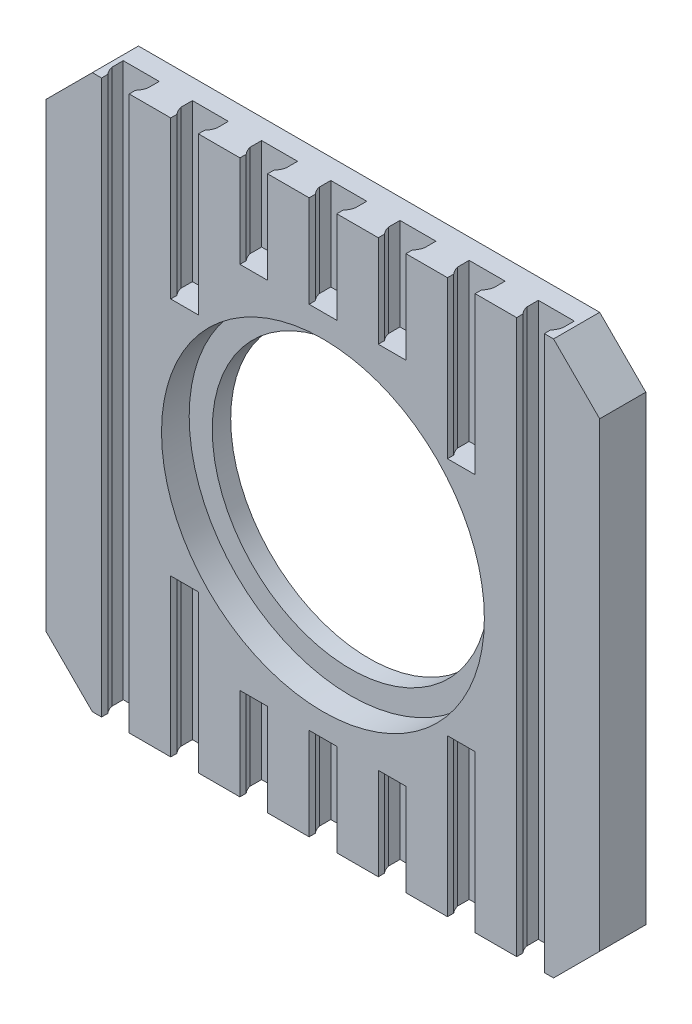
from build123d import *

# Parameters (mm, degrees)
SKETCH_1_R          = 45
EXTRUDE_1_DEPTH     = 5
SKETCH_2_W          = 60
SKETCH_2_H          = 60
EXTRUDE_2_DEPTH     = 5
CUT_EXTRUDE_1_DEPTH = 10
CUT_EXTRUDE_START   = -50
CUT_EXTRUDE_2_DEPTH = 10
CUT_EXTRUDE_3_DEPTH = 17
CUT_EXTRUDE_START_2 = -43
CUT_EXTRUDE_4_DEPTH = 17
CUT_EXTRUDE_5_REACH = 89.607
CHAMFER_1_SIZE      = 5
SKETCH_6_R          = 17.5
CUT_EXTRUDE_6_DEPTH = 3
SKETCH_7_R          = 15
CUT_EXTRUDE_7_DEPTH = 65.02343321
SKETCH_8_R          = 45
CUT_EXTRUDE_9_DEPTH = 10


with BuildPart() as part:
    # Sketch 1 → Extrude 1 (new body)
    with BuildSketch(Plane.XY):
        Circle(SKETCH_1_R)
    extrude(amount=-EXTRUDE_1_DEPTH)

    # Sketch 2 → Extrude 2 (add)
    with BuildSketch(Plane.XY):
        Rectangle(SKETCH_2_W, SKETCH_2_H)
    extrude(amount=EXTRUDE_2_DEPTH)

    # Sketch 3 → Cut-Extrude 1 (cut)
    with BuildSketch(Plane.XZ.offset(30)):
        with BuildLine():
            Line((-1.5, 5), (1.5, 5))
            Line((1.5, 5), (1.5, 4.322875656))
            ThreePointArc((1.5, 4.322875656), (1.780042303, 3.911838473), (1.95, 3.444409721))
            Line((1.95, 3.444409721), (1.95, 2.2))
            Line((1.95, 2.2), (-1.95, 2.2))
            Line((-1.95, 2.2), (-1.95, 3.444409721))
            ThreePointArc((-1.95, 3.444409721), (-1.780042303, 3.911838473), (-1.5, 4.322875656))
            Line((-1.5, 4.322875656), (-1.5, 5))
        make_face()
        with BuildLine():
            Line((6, 5), (6, 4.322875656))
            ThreePointArc((6, 4.322875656), (5.719957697, 3.911838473), (5.55, 3.444409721))
            Line((5.55, 3.444409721), (5.55, 2.2))
            Line((5.55, 2.2), (9.45, 2.2))
            Line((9.45, 2.2), (9.45, 3.444409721))
            ThreePointArc((9.45, 3.444409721), (9.280042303, 3.911838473), (9, 4.322875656))
            Line((9, 4.322875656), (9, 5))
            Line((9, 5), (6, 5))
        make_face()
        with BuildLine():
            Line((-9, 5), (-9, 4.322875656))
            ThreePointArc((-9, 4.322875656), (-9.280042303, 3.911838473), (-9.45, 3.444409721))
            Line((-9.45, 3.444409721), (-9.45, 2.2))
            Line((-9.45, 2.2), (-5.55, 2.2))
            Line((-5.55, 2.2), (-5.55, 3.444409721))
            ThreePointArc((-5.55, 3.444409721), (-5.719957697, 3.911838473), (-6, 4.322875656))
            Line((-6, 4.322875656), (-6, 5))
            Line((-6, 5), (-9, 5))
        make_face()
    extrude(amount=-CUT_EXTRUDE_1_DEPTH, mode=Mode.SUBTRACT)

    # Sketch 3_2 → Cut-Extrude 2 (cut)
    with BuildSketch(Plane.XZ.offset(30).offset(CUT_EXTRUDE_START)):
        with BuildLine():
            Line((-1.5, 5), (1.5, 5))
            Line((1.5, 5), (1.5, 4.322875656))
            ThreePointArc((1.5, 4.322875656), (1.780042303, 3.911838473), (1.95, 3.444409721))
            Line((1.95, 3.444409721), (1.95, 2.2))
            Line((1.95, 2.2), (-1.95, 2.2))
            Line((-1.95, 2.2), (-1.95, 3.444409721))
            ThreePointArc((-1.95, 3.444409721), (-1.780042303, 3.911838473), (-1.5, 4.322875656))
            Line((-1.5, 4.322875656), (-1.5, 5))
        make_face()
        with BuildLine():
            Line((6, 5), (6, 4.322875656))
            ThreePointArc((6, 4.322875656), (5.719957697, 3.911838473), (5.55, 3.444409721))
            Line((5.55, 3.444409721), (5.55, 2.2))
            Line((5.55, 2.2), (9.45, 2.2))
            Line((9.45, 2.2), (9.45, 3.444409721))
            ThreePointArc((9.45, 3.444409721), (9.280042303, 3.911838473), (9, 4.322875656))
            Line((9, 4.322875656), (9, 5))
            Line((9, 5), (6, 5))
        make_face()
        with BuildLine():
            Line((-9, 5), (-9, 4.322875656))
            ThreePointArc((-9, 4.322875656), (-9.280042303, 3.911838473), (-9.45, 3.444409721))
            Line((-9.45, 3.444409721), (-9.45, 2.2))
            Line((-9.45, 2.2), (-5.55, 2.2))
            Line((-5.55, 2.2), (-5.55, 3.444409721))
            ThreePointArc((-5.55, 3.444409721), (-5.719957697, 3.911838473), (-6, 4.322875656))
            Line((-6, 4.322875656), (-6, 5))
            Line((-6, 5), (-9, 5))
        make_face()
    extrude(amount=-CUT_EXTRUDE_2_DEPTH, mode=Mode.SUBTRACT)

    # Sketch 4 → Cut-Extrude 3 (cut)
    with BuildSketch(Plane.XZ.offset(30)):
        with BuildLine():
            Line((-16.5, 5), (-13.5, 5))
            Line((-13.5, 5), (-13.5, 4.322875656))
            ThreePointArc((-13.5, 4.322875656), (-13.219957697, 3.911838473), (-13.05, 3.444409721))
            Line((-13.05, 3.444409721), (-13.05, 2.2))
            Line((-13.05, 2.2), (-16.95, 2.2))
            Line((-16.95, 2.2), (-16.95, 3.444409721))
            ThreePointArc((-16.95, 3.444409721), (-16.780042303, 3.911838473), (-16.5, 4.322875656))
            Line((-16.5, 4.322875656), (-16.5, 5))
        make_face()
        with BuildLine():
            Line((13.5, 5), (16.5, 5))
            Line((16.5, 5), (16.5, 4.322875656))
            ThreePointArc((16.5, 4.322875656), (16.780042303, 3.911838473), (16.95, 3.444409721))
            Line((16.95, 3.444409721), (16.95, 2.2))
            Line((16.95, 2.2), (13.05, 2.2))
            Line((13.05, 2.2), (13.05, 3.444409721))
            ThreePointArc((13.05, 3.444409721), (13.219957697, 3.911838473), (13.5, 4.322875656))
            Line((13.5, 4.322875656), (13.5, 5))
        make_face()
    extrude(amount=-CUT_EXTRUDE_3_DEPTH, mode=Mode.SUBTRACT)

    # Sketch 4_2 → Cut-Extrude 4 (cut)
    with BuildSketch(Plane.XZ.offset(30).offset(CUT_EXTRUDE_START_2)):
        with BuildLine():
            Line((-16.5, 5), (-13.5, 5))
            Line((-13.5, 5), (-13.5, 4.322875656))
            ThreePointArc((-13.5, 4.322875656), (-13.219957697, 3.911838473), (-13.05, 3.444409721))
            Line((-13.05, 3.444409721), (-13.05, 2.2))
            Line((-13.05, 2.2), (-16.95, 2.2))
            Line((-16.95, 2.2), (-16.95, 3.444409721))
            ThreePointArc((-16.95, 3.444409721), (-16.780042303, 3.911838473), (-16.5, 4.322875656))
            Line((-16.5, 4.322875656), (-16.5, 5))
        make_face()
        with BuildLine():
            Line((13.5, 5), (16.5, 5))
            Line((16.5, 5), (16.5, 4.322875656))
            ThreePointArc((16.5, 4.322875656), (16.780042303, 3.911838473), (16.95, 3.444409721))
            Line((16.95, 3.444409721), (16.95, 2.2))
            Line((16.95, 2.2), (13.05, 2.2))
            Line((13.05, 2.2), (13.05, 3.444409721))
            ThreePointArc((13.05, 3.444409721), (13.219957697, 3.911838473), (13.5, 4.322875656))
            Line((13.5, 4.322875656), (13.5, 5))
        make_face()
    extrude(amount=-CUT_EXTRUDE_4_DEPTH, mode=Mode.SUBTRACT)

    # Sketch 5 → Cut-Extrude 5 (cut, up to next)
    with BuildSketch(Plane.XZ.offset(30), mode=Mode.PRIVATE) as cut_extrude_5_sk1:
        with BuildLine():
            Line((-21, 5), (-21, 4.322875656))
            ThreePointArc((-21, 4.322875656), (-20.719957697, 3.911838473), (-20.55, 3.444409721))
            Line((-20.55, 3.444409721), (-20.55, 2.2))
            Line((-20.55, 2.2), (-24.45, 2.2))
            Line((-24.45, 2.2), (-24.45, 3.444409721))
            ThreePointArc((-24.45, 3.444409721), (-24.280042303, 3.911838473), (-24, 4.322875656))
            Line((-24, 4.322875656), (-24, 5))
            Line((-24, 5), (-21, 5))
        make_face()
    cut_extrude_5_tool1 = extrude(cut_extrude_5_sk1.sketch, amount=-CUT_EXTRUDE_5_REACH, mode=Mode.PRIVATE) & part.part
    # Sketch 5 → Cut-Extrude 5 (cut, up to next)
    with BuildSketch(Plane.XZ.offset(30), mode=Mode.PRIVATE) as cut_extrude_5_sk2:
        with BuildLine():
            Line((24, 5), (24, 4.322875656))
            ThreePointArc((24, 4.322875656), (24.280042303, 3.911838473), (24.45, 3.444409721))
            Line((24.45, 3.444409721), (24.45, 2.2))
            Line((24.45, 2.2), (20.55, 2.2))
            Line((20.55, 2.2), (20.55, 3.444409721))
            ThreePointArc((20.55, 3.444409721), (20.719957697, 3.911838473), (21, 4.322875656))
            Line((21, 4.322875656), (21, 5))
            Line((21, 5), (24, 5))
        make_face()
    cut_extrude_5_tool2 = extrude(cut_extrude_5_sk2.sketch, amount=-CUT_EXTRUDE_5_REACH, mode=Mode.PRIVATE) & part.part
    add(cut_extrude_5_tool1.solids().sort_by_distance((-22.5, -30, 3.520698))[0], mode=Mode.SUBTRACT)
    add(cut_extrude_5_tool2.solids().sort_by_distance((22.5, -30, 3.520698))[0], mode=Mode.SUBTRACT)

    # Chamfer 1
    chamfer_1_edges = [part.edges().sort_by_distance(p)[0] for p in [
        (-30, 30, 2.5),
        (-30, -30, 2.5),
        (30, -30, 2.5),
        (30, 30, 2.5),
    ]]
    chamfer(chamfer_1_edges, length=CHAMFER_1_SIZE)

    # Sketch 6 → Cut-Extrude 6 (cut)
    with BuildSketch(Plane.XY.offset(5)):
        Circle(SKETCH_6_R)
    extrude(amount=-CUT_EXTRUDE_6_DEPTH, mode=Mode.SUBTRACT)

    # Sketch 7 → Cut-Extrude 7 (cut, through all)
    with BuildSketch(Plane.XY.offset(2)):
        Circle(SKETCH_7_R)
    extrude(amount=-CUT_EXTRUDE_7_DEPTH, mode=Mode.SUBTRACT)

    # Sketch 8 → Cut-Extrude 9 (cut)
    with BuildSketch(Plane.XY):
        Circle(SKETCH_8_R)
    extrude(amount=-CUT_EXTRUDE_9_DEPTH, mode=Mode.SUBTRACT)


solid = part.part
